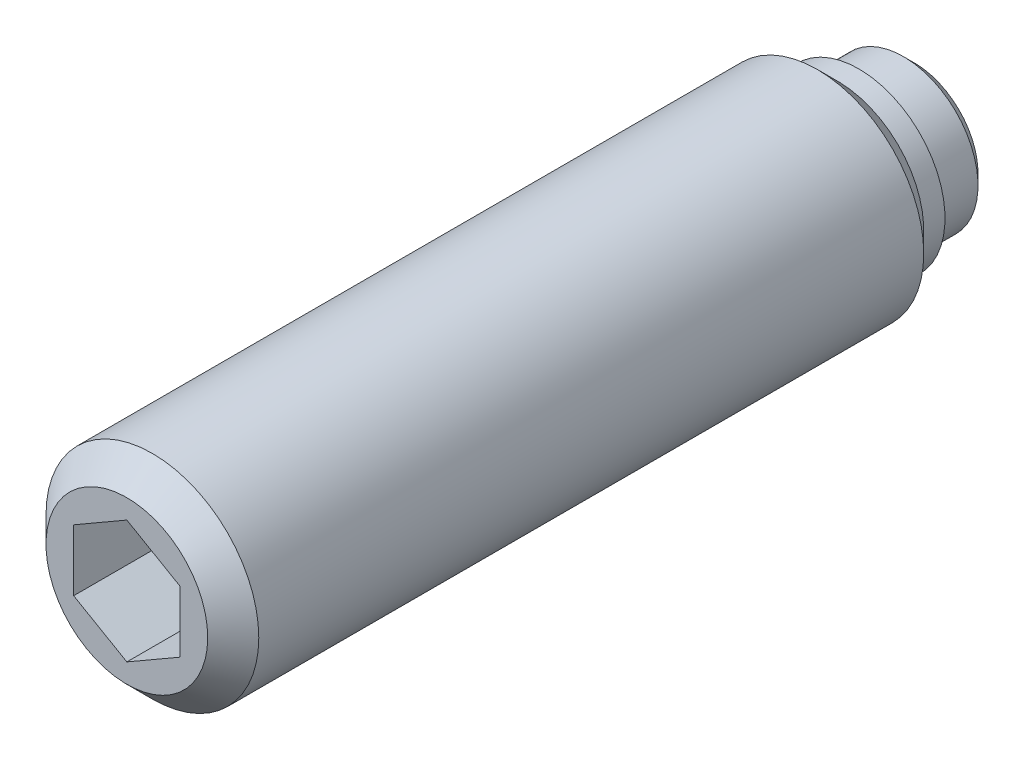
ISO-10303-21;
HEADER;
FILE_DESCRIPTION(('STEP AP214'),'2;1');
FILE_NAME('part.step','',(''),(''),'','','');
FILE_SCHEMA(('AUTOMOTIVE_DESIGN { 1 0 10303 214 1 1 1 1 }'));
ENDSEC;
DATA;
#1=APPLICATION_CONTEXT('core data for automotive mechanical design processes');
#2=APPLICATION_PROTOCOL_DEFINITION('international standard','automotive_design',2000,#1);
#3=PRODUCT_CONTEXT('',#1,'mechanical');
#4=PRODUCT('Part','Part','',(#3));
#5=PRODUCT_RELATED_PRODUCT_CATEGORY('part','',(#4));
#6=PRODUCT_DEFINITION_FORMATION('','',#4);
#7=PRODUCT_DEFINITION_CONTEXT('part definition',#1,'design');
#8=PRODUCT_DEFINITION('design','',#6,#7);
#9=PRODUCT_DEFINITION_SHAPE('','',#8);
#10=(LENGTH_UNIT() NAMED_UNIT(*) SI_UNIT(.MILLI.,.METRE.));
#11=(NAMED_UNIT(*) PLANE_ANGLE_UNIT() SI_UNIT($,.RADIAN.));
#12=(NAMED_UNIT(*) SI_UNIT($,.STERADIAN.) SOLID_ANGLE_UNIT());
#13=UNCERTAINTY_MEASURE_WITH_UNIT(LENGTH_MEASURE(1.E-05),#10,'distance_accuracy_value','');
#14=(GEOMETRIC_REPRESENTATION_CONTEXT(3) GLOBAL_UNCERTAINTY_ASSIGNED_CONTEXT((#13)) GLOBAL_UNIT_ASSIGNED_CONTEXT((#10,
#11,#12)) REPRESENTATION_CONTEXT('',''));
#15=CARTESIAN_POINT('',(0.,0.,0.));
#16=DIRECTION('',(0.,0.,1.));
#17=DIRECTION('',(1.,0.,0.));
#18=AXIS2_PLACEMENT_3D('',#15,#16,#17);
#19=CARTESIAN_POINT('',(0.,0.,2.6));
#20=DIRECTION('',(0.,0.,-1.));
#21=DIRECTION('',(-1.,0.,0.));
#22=AXIS2_PLACEMENT_3D('',#19,#20,#21);
#23=CYLINDRICAL_SURFACE('',#22,5.);
#24=CARTESIAN_POINT('',(0.,0.,4.55));
#25=DIRECTION('',(0.,0.,-1.));
#26=DIRECTION('',(-1.,0.,0.));
#27=AXIS2_PLACEMENT_3D('',#24,#25,#26);
#28=CIRCLE('',#27,5.);
#29=CARTESIAN_POINT('',(-5.,0.,4.55));
#30=VERTEX_POINT('',#29);
#31=EDGE_CURVE('E9',#30,#30,#28,.T.);
#32=ORIENTED_EDGE('',*,*,#31,.F.);
#33=EDGE_LOOP('',(#32));
#34=FACE_BOUND('',#33,.T.);
#35=CARTESIAN_POINT('',(0.,0.,35.8));
#36=DIRECTION('',(0.,0.,1.));
#37=DIRECTION('',(1.,0.,0.));
#38=AXIS2_PLACEMENT_3D('',#35,#36,#37);
#39=CIRCLE('',#38,5.);
#40=CARTESIAN_POINT('',(5.,0.,35.8));
#41=VERTEX_POINT('',#40);
#42=EDGE_CURVE('E123',#41,#41,#39,.T.);
#43=ORIENTED_EDGE('',*,*,#42,.F.);
#44=EDGE_LOOP('',(#43));
#45=FACE_BOUND('',#44,.T.);
#46=ADVANCED_FACE('F14',(#34,#45),#23,.T.);
#47=CARTESIAN_POINT('',(0.,0.,4.55));
#48=DIRECTION('',(0.,0.,1.));
#49=DIRECTION('',(1.,0.,0.));
#50=AXIS2_PLACEMENT_3D('',#47,#48,#49);
#51=CONICAL_SURFACE('',#50,5.,0.785398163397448);
#52=ORIENTED_EDGE('',*,*,#31,.T.);
#53=EDGE_LOOP('',(#52));
#54=FACE_BOUND('',#53,.T.);
#55=CARTESIAN_POINT('',(0.,0.,3.6));
#56=DIRECTION('',(0.,0.,-1.));
#57=DIRECTION('',(-1.,0.,0.));
#58=AXIS2_PLACEMENT_3D('',#55,#56,#57);
#59=CIRCLE('',#58,4.05);
#60=CARTESIAN_POINT('',(-4.05,0.,3.6));
#61=VERTEX_POINT('',#60);
#62=EDGE_CURVE('E21',#61,#61,#59,.T.);
#63=ORIENTED_EDGE('',*,*,#62,.F.);
#64=EDGE_LOOP('',(#63));
#65=FACE_BOUND('',#64,.T.);
#66=ADVANCED_FACE('F143',(#54,#65),#51,.T.);
#67=CARTESIAN_POINT('',(0.,0.,2.6));
#68=DIRECTION('',(0.,0.,-1.));
#69=DIRECTION('',(-1.,0.,0.));
#70=AXIS2_PLACEMENT_3D('',#67,#68,#69);
#71=CYLINDRICAL_SURFACE('',#70,4.05);
#72=ORIENTED_EDGE('',*,*,#62,.T.);
#73=EDGE_LOOP('',(#72));
#74=FACE_BOUND('',#73,.T.);
#75=CARTESIAN_POINT('',(0.,0.,2.6));
#76=DIRECTION('',(0.,0.,-1.));
#77=DIRECTION('',(-1.,0.,0.));
#78=AXIS2_PLACEMENT_3D('',#75,#76,#77);
#79=CIRCLE('',#78,4.05);
#80=CARTESIAN_POINT('',(-4.05,0.,2.6));
#81=VERTEX_POINT('',#80);
#82=EDGE_CURVE('E135',#81,#81,#79,.T.);
#83=ORIENTED_EDGE('',*,*,#82,.F.);
#84=EDGE_LOOP('',(#83));
#85=FACE_BOUND('',#84,.T.);
#86=ADVANCED_FACE('F140',(#74,#85),#71,.T.);
#87=CARTESIAN_POINT('',(0.,4.05,2.6));
#88=DIRECTION('',(0.,0.,1.));
#89=DIRECTION('',(1.,0.,0.));
#90=AXIS2_PLACEMENT_3D('',#87,#88,#89);
#91=PLANE('',#90);
#92=ORIENTED_EDGE('',*,*,#82,.T.);
#93=EDGE_LOOP('',(#92));
#94=FACE_BOUND('',#93,.T.);
#95=CARTESIAN_POINT('',(0.,0.,2.6));
#96=DIRECTION('',(0.,0.,-1.));
#97=DIRECTION('',(-1.,0.,0.));
#98=AXIS2_PLACEMENT_3D('',#95,#96,#97);
#99=CIRCLE('',#98,3.5);
#100=CARTESIAN_POINT('',(-3.5,0.,2.6));
#101=VERTEX_POINT('',#100);
#102=EDGE_CURVE('E132',#101,#101,#99,.T.);
#103=ORIENTED_EDGE('',*,*,#102,.F.);
#104=EDGE_LOOP('',(#103));
#105=FACE_BOUND('',#104,.T.);
#106=ADVANCED_FACE('F151',(#94,#105),#91,.F.);
#107=CARTESIAN_POINT('',(0.,0.,0.));
#108=DIRECTION('',(0.,0.,-1.));
#109=DIRECTION('',(-1.,0.,0.));
#110=AXIS2_PLACEMENT_3D('',#107,#108,#109);
#111=CYLINDRICAL_SURFACE('',#110,3.5);
#112=CARTESIAN_POINT('',(0.,0.,0.5));
#113=DIRECTION('',(0.,0.,-1.));
#114=DIRECTION('',(-1.,0.,0.));
#115=AXIS2_PLACEMENT_3D('',#112,#113,#114);
#116=CIRCLE('',#115,3.5);
#117=CARTESIAN_POINT('',(-3.5,0.,0.5));
#118=VERTEX_POINT('',#117);
#119=EDGE_CURVE('E129',#118,#118,#116,.T.);
#120=ORIENTED_EDGE('',*,*,#119,.F.);
#121=EDGE_LOOP('',(#120));
#122=FACE_BOUND('',#121,.T.);
#123=ORIENTED_EDGE('',*,*,#102,.T.);
#124=EDGE_LOOP('',(#123));
#125=FACE_BOUND('',#124,.T.);
#126=ADVANCED_FACE('F157',(#122,#125),#111,.T.);
#127=CARTESIAN_POINT('',(0.,0.,0.5));
#128=DIRECTION('',(0.,0.,1.));
#129=DIRECTION('',(1.,0.,0.));
#130=AXIS2_PLACEMENT_3D('',#127,#128,#129);
#131=CONICAL_SURFACE('',#130,3.5,0.785398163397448);
#132=CARTESIAN_POINT('',(0.,0.,0.));
#133=DIRECTION('',(0.,0.,-1.));
#134=DIRECTION('',(-1.,0.,0.));
#135=AXIS2_PLACEMENT_3D('',#132,#133,#134);
#136=CIRCLE('',#135,3.);
#137=CARTESIAN_POINT('',(-3.,0.,0.));
#138=VERTEX_POINT('',#137);
#139=EDGE_CURVE('E126',#138,#138,#136,.T.);
#140=ORIENTED_EDGE('',*,*,#139,.F.);
#141=EDGE_LOOP('',(#140));
#142=FACE_BOUND('',#141,.T.);
#143=ORIENTED_EDGE('',*,*,#119,.T.);
#144=EDGE_LOOP('',(#143));
#145=FACE_BOUND('',#144,.T.);
#146=ADVANCED_FACE('F161',(#142,#145),#131,.T.);
#147=CARTESIAN_POINT('',(0.,3.,0.));
#148=DIRECTION('',(0.,0.,1.));
#149=DIRECTION('',(1.,0.,0.));
#150=AXIS2_PLACEMENT_3D('',#147,#148,#149);
#151=PLANE('',#150);
#152=ORIENTED_EDGE('',*,*,#139,.T.);
#153=EDGE_LOOP('',(#152));
#154=FACE_BOUND('',#153,.T.);
#155=ADVANCED_FACE('F165',(#154),#151,.F.);
#156=CARTESIAN_POINT('',(0.,0.,37.));
#157=DIRECTION('',(0.,0.,-1.));
#158=DIRECTION('',(-1.,0.,0.));
#159=AXIS2_PLACEMENT_3D('',#156,#157,#158);
#160=CONICAL_SURFACE('',#159,3.8,0.785398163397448);
#161=ORIENTED_EDGE('',*,*,#42,.T.);
#162=EDGE_LOOP('',(#161));
#163=FACE_BOUND('',#162,.T.);
#164=CARTESIAN_POINT('',(0.,0.,37.));
#165=DIRECTION('',(0.,0.,1.));
#166=DIRECTION('',(1.,0.,0.));
#167=AXIS2_PLACEMENT_3D('',#164,#165,#166);
#168=CIRCLE('',#167,3.8);
#169=CARTESIAN_POINT('',(3.8,0.,37.));
#170=VERTEX_POINT('',#169);
#171=EDGE_CURVE('E115',#170,#170,#168,.T.);
#172=ORIENTED_EDGE('',*,*,#171,.F.);
#173=EDGE_LOOP('',(#172));
#174=FACE_BOUND('',#173,.T.);
#175=ADVANCED_FACE('F169',(#163,#174),#160,.T.);
#176=CARTESIAN_POINT('',(0.,-3.8,37.));
#177=DIRECTION('',(0.,0.,1.));
#178=DIRECTION('',(1.,0.,0.));
#179=AXIS2_PLACEMENT_3D('',#176,#177,#178);
#180=PLANE('',#179);
#181=DIRECTION('',(0.866025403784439,-0.5,0.));
#182=VECTOR('',#181,1.);
#183=CARTESIAN_POINT('',(-2.5,-1.44337567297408,37.));
#184=LINE('',#183,#182);
#185=CARTESIAN_POINT('',(-2.5,-1.44337567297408,37.));
#186=VERTEX_POINT('',#185);
#187=CARTESIAN_POINT('',(0.,-2.88675134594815,37.));
#188=VERTEX_POINT('',#187);
#189=EDGE_CURVE('E28',#186,#188,#184,.T.);
#190=ORIENTED_EDGE('',*,*,#189,.F.);
#191=DIRECTION('',(0.,-1.,0.));
#192=VECTOR('',#191,1.);
#193=CARTESIAN_POINT('',(-2.5,1.44337567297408,37.));
#194=LINE('',#193,#192);
#195=CARTESIAN_POINT('',(-2.5,1.44337567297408,37.));
#196=VERTEX_POINT('',#195);
#197=EDGE_CURVE('E111',#196,#186,#194,.T.);
#198=ORIENTED_EDGE('',*,*,#197,.F.);
#199=DIRECTION('',(-0.866025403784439,-0.5,0.));
#200=VECTOR('',#199,1.);
#201=CARTESIAN_POINT('',(0.,2.88675134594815,37.));
#202=LINE('',#201,#200);
#203=CARTESIAN_POINT('',(0.,2.88675134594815,37.));
#204=VERTEX_POINT('',#203);
#205=EDGE_CURVE('E109',#204,#196,#202,.T.);
#206=ORIENTED_EDGE('',*,*,#205,.F.);
#207=DIRECTION('',(-0.866025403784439,0.5,0.));
#208=VECTOR('',#207,1.);
#209=CARTESIAN_POINT('',(2.5,1.44337567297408,37.));
#210=LINE('',#209,#208);
#211=CARTESIAN_POINT('',(2.5,1.44337567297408,37.));
#212=VERTEX_POINT('',#211);
#213=EDGE_CURVE('E76',#212,#204,#210,.T.);
#214=ORIENTED_EDGE('',*,*,#213,.F.);
#215=DIRECTION('',(0.,1.,0.));
#216=VECTOR('',#215,1.);
#217=CARTESIAN_POINT('',(2.5,-1.44337567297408,37.));
#218=LINE('',#217,#216);
#219=CARTESIAN_POINT('',(2.5,-1.44337567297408,37.));
#220=VERTEX_POINT('',#219);
#221=EDGE_CURVE('E105',#220,#212,#218,.T.);
#222=ORIENTED_EDGE('',*,*,#221,.F.);
#223=DIRECTION('',(0.866025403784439,0.5,0.));
#224=VECTOR('',#223,1.);
#225=CARTESIAN_POINT('',(0.,-2.88675134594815,37.));
#226=LINE('',#225,#224);
#227=EDGE_CURVE('E102',#188,#220,#226,.T.);
#228=ORIENTED_EDGE('',*,*,#227,.F.);
#229=EDGE_LOOP('',(#190,#198,#206,#214,#222,#228));
#230=FACE_BOUND('',#229,.T.);
#231=ORIENTED_EDGE('',*,*,#171,.T.);
#232=EDGE_LOOP('',(#231));
#233=FACE_BOUND('',#232,.T.);
#234=ADVANCED_FACE('F173',(#230,#233),#180,.T.);
#235=CARTESIAN_POINT('',(-2.5,-1.44337567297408,31.));
#236=DIRECTION('',(-0.5,-0.866025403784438,0.));
#237=DIRECTION('',(0.866025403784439,-0.5,0.));
#238=AXIS2_PLACEMENT_3D('',#235,#236,#237);
#239=PLANE('',#238);
#240=ORIENTED_EDGE('',*,*,#189,.T.);
#241=DIRECTION('',(0.,0.,1.));
#242=VECTOR('',#241,1.);
#243=CARTESIAN_POINT('',(0.,-2.88675134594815,31.));
#244=LINE('',#243,#242);
#245=CARTESIAN_POINT('',(0.,-2.88675134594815,31.));
#246=VERTEX_POINT('',#245);
#247=EDGE_CURVE('E58',#246,#188,#244,.T.);
#248=ORIENTED_EDGE('',*,*,#247,.F.);
#249=DIRECTION('',(0.866025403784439,-0.5,0.));
#250=VECTOR('',#249,1.);
#251=CARTESIAN_POINT('',(-2.5,-1.44337567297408,31.));
#252=LINE('',#251,#250);
#253=CARTESIAN_POINT('',(-2.5,-1.44337567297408,31.));
#254=VERTEX_POINT('',#253);
#255=EDGE_CURVE('E113',#254,#246,#252,.T.);
#256=ORIENTED_EDGE('',*,*,#255,.F.);
#257=DIRECTION('',(0.,0.,1.));
#258=VECTOR('',#257,1.);
#259=CARTESIAN_POINT('',(-2.5,-1.44337567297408,31.));
#260=LINE('',#259,#258);
#261=EDGE_CURVE('E36',#254,#186,#260,.T.);
#262=ORIENTED_EDGE('',*,*,#261,.T.);
#263=EDGE_LOOP('',(#240,#248,#256,#262));
#264=FACE_BOUND('',#263,.T.);
#265=ADVANCED_FACE('F177',(#264),#239,.F.);
#266=CARTESIAN_POINT('',(-2.5,1.44337567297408,31.));
#267=DIRECTION('',(-1.,0.,0.));
#268=DIRECTION('',(0.,0.,1.));
#269=AXIS2_PLACEMENT_3D('',#266,#267,#268);
#270=PLANE('',#269);
#271=ORIENTED_EDGE('',*,*,#197,.T.);
#272=ORIENTED_EDGE('',*,*,#261,.F.);
#273=DIRECTION('',(0.,-1.,0.));
#274=VECTOR('',#273,1.);
#275=CARTESIAN_POINT('',(-2.5,1.44337567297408,31.));
#276=LINE('',#275,#274);
#277=CARTESIAN_POINT('',(-2.5,1.44337567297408,31.));
#278=VERTEX_POINT('',#277);
#279=EDGE_CURVE('E88',#278,#254,#276,.T.);
#280=ORIENTED_EDGE('',*,*,#279,.F.);
#281=DIRECTION('',(0.,0.,1.));
#282=VECTOR('',#281,1.);
#283=CARTESIAN_POINT('',(-2.5,1.44337567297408,31.));
#284=LINE('',#283,#282);
#285=EDGE_CURVE('E80',#278,#196,#284,.T.);
#286=ORIENTED_EDGE('',*,*,#285,.T.);
#287=EDGE_LOOP('',(#271,#272,#280,#286));
#288=FACE_BOUND('',#287,.T.);
#289=ADVANCED_FACE('F181',(#288),#270,.F.);
#290=CARTESIAN_POINT('',(0.,2.88675134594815,31.));
#291=DIRECTION('',(-0.5,0.866025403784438,0.));
#292=DIRECTION('',(-0.866025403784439,-0.5,0.));
#293=AXIS2_PLACEMENT_3D('',#290,#291,#292);
#294=PLANE('',#293);
#295=ORIENTED_EDGE('',*,*,#205,.T.);
#296=ORIENTED_EDGE('',*,*,#285,.F.);
#297=DIRECTION('',(-0.866025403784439,-0.5,0.));
#298=VECTOR('',#297,1.);
#299=CARTESIAN_POINT('',(0.,2.88675134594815,31.));
#300=LINE('',#299,#298);
#301=CARTESIAN_POINT('',(0.,2.88675134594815,31.));
#302=VERTEX_POINT('',#301);
#303=EDGE_CURVE('E84',#302,#278,#300,.T.);
#304=ORIENTED_EDGE('',*,*,#303,.F.);
#305=DIRECTION('',(0.,0.,1.));
#306=VECTOR('',#305,1.);
#307=CARTESIAN_POINT('',(0.,2.88675134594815,31.));
#308=LINE('',#307,#306);
#309=EDGE_CURVE('E69',#302,#204,#308,.T.);
#310=ORIENTED_EDGE('',*,*,#309,.T.);
#311=EDGE_LOOP('',(#295,#296,#304,#310));
#312=FACE_BOUND('',#311,.T.);
#313=ADVANCED_FACE('F85',(#312),#294,.F.);
#314=CARTESIAN_POINT('',(2.5,1.44337567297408,31.));
#315=DIRECTION('',(0.5,0.866025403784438,0.));
#316=DIRECTION('',(-0.866025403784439,0.5,0.));
#317=AXIS2_PLACEMENT_3D('',#314,#315,#316);
#318=PLANE('',#317);
#319=ORIENTED_EDGE('',*,*,#213,.T.);
#320=ORIENTED_EDGE('',*,*,#309,.F.);
#321=DIRECTION('',(-0.866025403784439,0.5,0.));
#322=VECTOR('',#321,1.);
#323=CARTESIAN_POINT('',(2.5,1.44337567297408,31.));
#324=LINE('',#323,#322);
#325=CARTESIAN_POINT('',(2.5,1.44337567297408,31.));
#326=VERTEX_POINT('',#325);
#327=EDGE_CURVE('E73',#326,#302,#324,.T.);
#328=ORIENTED_EDGE('',*,*,#327,.F.);
#329=DIRECTION('',(0.,0.,1.));
#330=VECTOR('',#329,1.);
#331=CARTESIAN_POINT('',(2.5,1.44337567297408,31.));
#332=LINE('',#331,#330);
#333=EDGE_CURVE('E81',#326,#212,#332,.T.);
#334=ORIENTED_EDGE('',*,*,#333,.T.);
#335=EDGE_LOOP('',(#319,#320,#328,#334));
#336=FACE_BOUND('',#335,.T.);
#337=ADVANCED_FACE('F71',(#336),#318,.F.);
#338=CARTESIAN_POINT('',(2.5,-1.44337567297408,31.));
#339=DIRECTION('',(1.,0.,0.));
#340=DIRECTION('',(0.,0.,-1.));
#341=AXIS2_PLACEMENT_3D('',#338,#339,#340);
#342=PLANE('',#341);
#343=ORIENTED_EDGE('',*,*,#221,.T.);
#344=ORIENTED_EDGE('',*,*,#333,.F.);
#345=DIRECTION('',(0.,1.,0.));
#346=VECTOR('',#345,1.);
#347=CARTESIAN_POINT('',(2.5,-1.44337567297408,31.));
#348=LINE('',#347,#346);
#349=CARTESIAN_POINT('',(2.5,-1.44337567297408,31.));
#350=VERTEX_POINT('',#349);
#351=EDGE_CURVE('E94',#350,#326,#348,.T.);
#352=ORIENTED_EDGE('',*,*,#351,.F.);
#353=DIRECTION('',(0.,0.,1.));
#354=VECTOR('',#353,1.);
#355=CARTESIAN_POINT('',(2.5,-1.44337567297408,31.));
#356=LINE('',#355,#354);
#357=EDGE_CURVE('E118',#350,#220,#356,.T.);
#358=ORIENTED_EDGE('',*,*,#357,.T.);
#359=EDGE_LOOP('',(#343,#344,#352,#358));
#360=FACE_BOUND('',#359,.T.);
#361=ADVANCED_FACE('F185',(#360),#342,.F.);
#362=CARTESIAN_POINT('',(0.,-2.88675134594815,31.));
#363=DIRECTION('',(0.5,-0.866025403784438,0.));
#364=DIRECTION('',(0.866025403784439,0.5,0.));
#365=AXIS2_PLACEMENT_3D('',#362,#363,#364);
#366=PLANE('',#365);
#367=ORIENTED_EDGE('',*,*,#227,.T.);
#368=ORIENTED_EDGE('',*,*,#357,.F.);
#369=DIRECTION('',(0.866025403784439,0.5,0.));
#370=VECTOR('',#369,1.);
#371=CARTESIAN_POINT('',(0.,-2.88675134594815,31.));
#372=LINE('',#371,#370);
#373=EDGE_CURVE('E96',#246,#350,#372,.T.);
#374=ORIENTED_EDGE('',*,*,#373,.F.);
#375=ORIENTED_EDGE('',*,*,#247,.T.);
#376=EDGE_LOOP('',(#367,#368,#374,#375));
#377=FACE_BOUND('',#376,.T.);
#378=ADVANCED_FACE('F182',(#377),#366,.F.);
#379=CARTESIAN_POINT('',(0.,0.,31.));
#380=DIRECTION('',(0.,0.,1.));
#381=DIRECTION('',(1.,0.,0.));
#382=AXIS2_PLACEMENT_3D('',#379,#380,#381);
#383=PLANE('',#382);
#384=ORIENTED_EDGE('',*,*,#255,.T.);
#385=ORIENTED_EDGE('',*,*,#373,.T.);
#386=ORIENTED_EDGE('',*,*,#351,.T.);
#387=ORIENTED_EDGE('',*,*,#327,.T.);
#388=ORIENTED_EDGE('',*,*,#303,.T.);
#389=ORIENTED_EDGE('',*,*,#279,.T.);
#390=EDGE_LOOP('',(#384,#385,#386,#387,#388,#389));
#391=FACE_BOUND('',#390,.T.);
#392=ADVANCED_FACE('F91',(#391),#383,.T.);
#393=CLOSED_SHELL('',(#46,#66,#86,#106,#126,#146,#155,#175,#234,#265,#289,#313,#337,#361,#378,#392));
#394=MANIFOLD_SOLID_BREP('B1',#393);
#395=ADVANCED_BREP_SHAPE_REPRESENTATION('',(#18,#394),#14);
#396=SHAPE_DEFINITION_REPRESENTATION(#9,#395);
ENDSEC;
END-ISO-10303-21;
